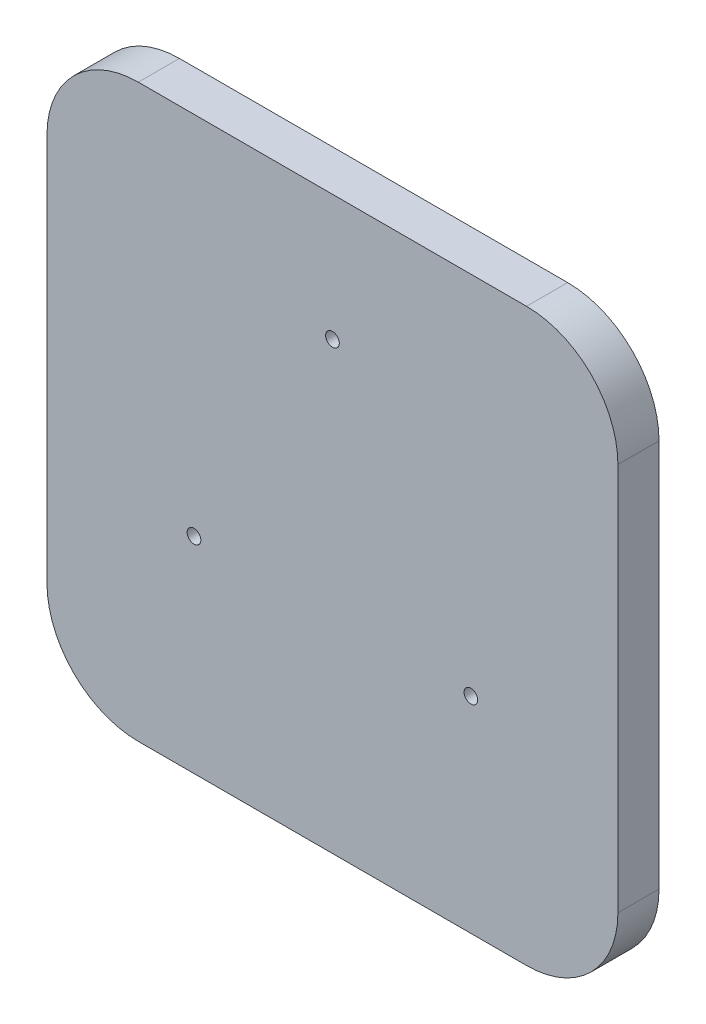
ISO-10303-21;
HEADER;
FILE_DESCRIPTION(('STEP AP214'),'2;1');
FILE_NAME('part.step','',(''),(''),'','','');
FILE_SCHEMA(('AUTOMOTIVE_DESIGN { 1 0 10303 214 1 1 1 1 }'));
ENDSEC;
DATA;
#1=APPLICATION_CONTEXT('core data for automotive mechanical design processes');
#2=APPLICATION_PROTOCOL_DEFINITION('international standard','automotive_design',2000,#1);
#3=PRODUCT_CONTEXT('',#1,'mechanical');
#4=PRODUCT('Part','Part','',(#3));
#5=PRODUCT_RELATED_PRODUCT_CATEGORY('part','',(#4));
#6=PRODUCT_DEFINITION_FORMATION('','',#4);
#7=PRODUCT_DEFINITION_CONTEXT('part definition',#1,'design');
#8=PRODUCT_DEFINITION('design','',#6,#7);
#9=PRODUCT_DEFINITION_SHAPE('','',#8);
#10=(LENGTH_UNIT() NAMED_UNIT(*) SI_UNIT(.MILLI.,.METRE.));
#11=(NAMED_UNIT(*) PLANE_ANGLE_UNIT() SI_UNIT($,.RADIAN.));
#12=(NAMED_UNIT(*) SI_UNIT($,.STERADIAN.) SOLID_ANGLE_UNIT());
#13=UNCERTAINTY_MEASURE_WITH_UNIT(LENGTH_MEASURE(1.E-05),#10,'distance_accuracy_value','');
#14=(GEOMETRIC_REPRESENTATION_CONTEXT(3) GLOBAL_UNCERTAINTY_ASSIGNED_CONTEXT((#13)) GLOBAL_UNIT_ASSIGNED_CONTEXT((#10,
#11,#12)) REPRESENTATION_CONTEXT('',''));
#15=CARTESIAN_POINT('',(0.,0.,0.));
#16=DIRECTION('',(0.,0.,1.));
#17=DIRECTION('',(1.,0.,0.));
#18=AXIS2_PLACEMENT_3D('',#15,#16,#17);
#19=CARTESIAN_POINT('',(0.,0.,18.));
#20=DIRECTION('',(1.,0.,0.));
#21=DIRECTION('',(0.,0.,-1.));
#22=AXIS2_PLACEMENT_3D('',#19,#20,#21);
#23=PLANE('',#22);
#24=DIRECTION('',(0.,-1.,0.));
#25=VECTOR('',#24,1.);
#26=CARTESIAN_POINT('',(0.,0.,0.));
#27=LINE('',#26,#25);
#28=CARTESIAN_POINT('',(0.,210.,0.));
#29=VERTEX_POINT('',#28);
#30=CARTESIAN_POINT('',(0.,40.,0.));
#31=VERTEX_POINT('',#30);
#32=EDGE_CURVE('E130',#29,#31,#27,.T.);
#33=ORIENTED_EDGE('',*,*,#32,.T.);
#34=DIRECTION('',(0.,0.,-1.));
#35=VECTOR('',#34,1.);
#36=CARTESIAN_POINT('',(0.,40.,18.));
#37=LINE('',#36,#35);
#38=CARTESIAN_POINT('',(0.,40.,18.));
#39=VERTEX_POINT('',#38);
#40=EDGE_CURVE('E152',#31,#39,#37,.F.);
#41=ORIENTED_EDGE('',*,*,#40,.T.);
#42=DIRECTION('',(0.,-1.,0.));
#43=VECTOR('',#42,1.);
#44=CARTESIAN_POINT('',(0.,0.,18.));
#45=LINE('',#44,#43);
#46=CARTESIAN_POINT('',(0.,210.,18.));
#47=VERTEX_POINT('',#46);
#48=EDGE_CURVE('E128',#47,#39,#45,.T.);
#49=ORIENTED_EDGE('',*,*,#48,.F.);
#50=DIRECTION('',(0.,0.,-1.));
#51=VECTOR('',#50,1.);
#52=CARTESIAN_POINT('',(0.,210.,18.));
#53=LINE('',#52,#51);
#54=EDGE_CURVE('E149',#47,#29,#53,.T.);
#55=ORIENTED_EDGE('',*,*,#54,.T.);
#56=EDGE_LOOP('',(#33,#41,#49,#55));
#57=FACE_BOUND('',#56,.T.);
#58=ADVANCED_FACE('F33',(#57),#23,.F.);
#59=CARTESIAN_POINT('',(0.,0.,18.));
#60=DIRECTION('',(0.,1.,0.));
#61=DIRECTION('',(0.,0.,1.));
#62=AXIS2_PLACEMENT_3D('',#59,#60,#61);
#63=PLANE('',#62);
#64=DIRECTION('',(1.,0.,0.));
#65=VECTOR('',#64,1.);
#66=CARTESIAN_POINT('',(0.,0.,0.));
#67=LINE('',#66,#65);
#68=CARTESIAN_POINT('',(40.,0.,0.));
#69=VERTEX_POINT('',#68);
#70=CARTESIAN_POINT('',(210.,0.,0.));
#71=VERTEX_POINT('',#70);
#72=EDGE_CURVE('E126',#69,#71,#67,.T.);
#73=ORIENTED_EDGE('',*,*,#72,.T.);
#74=DIRECTION('',(0.,0.,-1.));
#75=VECTOR('',#74,1.);
#76=CARTESIAN_POINT('',(210.,0.,18.));
#77=LINE('',#76,#75);
#78=CARTESIAN_POINT('',(210.,0.,18.));
#79=VERTEX_POINT('',#78);
#80=EDGE_CURVE('E104',#71,#79,#77,.F.);
#81=ORIENTED_EDGE('',*,*,#80,.T.);
#82=DIRECTION('',(1.,0.,0.));
#83=VECTOR('',#82,1.);
#84=CARTESIAN_POINT('',(0.,0.,18.));
#85=LINE('',#84,#83);
#86=CARTESIAN_POINT('',(40.,0.,18.));
#87=VERTEX_POINT('',#86);
#88=EDGE_CURVE('E166',#87,#79,#85,.T.);
#89=ORIENTED_EDGE('',*,*,#88,.F.);
#90=DIRECTION('',(0.,0.,-1.));
#91=VECTOR('',#90,1.);
#92=CARTESIAN_POINT('',(40.,0.,18.));
#93=LINE('',#92,#91);
#94=EDGE_CURVE('E109',#87,#69,#93,.T.);
#95=ORIENTED_EDGE('',*,*,#94,.T.);
#96=EDGE_LOOP('',(#73,#81,#89,#95));
#97=FACE_BOUND('',#96,.T.);
#98=ADVANCED_FACE('F171',(#97),#63,.F.);
#99=CARTESIAN_POINT('',(250.,0.,18.));
#100=DIRECTION('',(-1.,0.,0.));
#101=DIRECTION('',(0.,0.,1.));
#102=AXIS2_PLACEMENT_3D('',#99,#100,#101);
#103=PLANE('',#102);
#104=DIRECTION('',(0.,1.,0.));
#105=VECTOR('',#104,1.);
#106=CARTESIAN_POINT('',(250.,0.,18.));
#107=LINE('',#106,#105);
#108=CARTESIAN_POINT('',(250.,40.,18.));
#109=VERTEX_POINT('',#108);
#110=CARTESIAN_POINT('',(250.,210.,18.));
#111=VERTEX_POINT('',#110);
#112=EDGE_CURVE('E118',#109,#111,#107,.T.);
#113=ORIENTED_EDGE('',*,*,#112,.F.);
#114=DIRECTION('',(0.,0.,-1.));
#115=VECTOR('',#114,1.);
#116=CARTESIAN_POINT('',(250.,40.,18.));
#117=LINE('',#116,#115);
#118=CARTESIAN_POINT('',(250.,40.,0.));
#119=VERTEX_POINT('',#118);
#120=EDGE_CURVE('E103',#109,#119,#117,.T.);
#121=ORIENTED_EDGE('',*,*,#120,.T.);
#122=DIRECTION('',(0.,1.,0.));
#123=VECTOR('',#122,1.);
#124=CARTESIAN_POINT('',(250.,0.,0.));
#125=LINE('',#124,#123);
#126=CARTESIAN_POINT('',(250.,210.,0.));
#127=VERTEX_POINT('',#126);
#128=EDGE_CURVE('E116',#119,#127,#125,.T.);
#129=ORIENTED_EDGE('',*,*,#128,.T.);
#130=DIRECTION('',(0.,0.,-1.));
#131=VECTOR('',#130,1.);
#132=CARTESIAN_POINT('',(250.,210.,18.));
#133=LINE('',#132,#131);
#134=EDGE_CURVE('E120',#127,#111,#133,.F.);
#135=ORIENTED_EDGE('',*,*,#134,.T.);
#136=EDGE_LOOP('',(#113,#121,#129,#135));
#137=FACE_BOUND('',#136,.T.);
#138=ADVANCED_FACE('F115',(#137),#103,.F.);
#139=CARTESIAN_POINT('',(0.,250.,18.));
#140=DIRECTION('',(0.,-1.,0.));
#141=DIRECTION('',(0.,0.,-1.));
#142=AXIS2_PLACEMENT_3D('',#139,#140,#141);
#143=PLANE('',#142);
#144=DIRECTION('',(-1.,0.,0.));
#145=VECTOR('',#144,1.);
#146=CARTESIAN_POINT('',(0.,250.,18.));
#147=LINE('',#146,#145);
#148=CARTESIAN_POINT('',(210.,250.,18.));
#149=VERTEX_POINT('',#148);
#150=CARTESIAN_POINT('',(40.,250.,18.));
#151=VERTEX_POINT('',#150);
#152=EDGE_CURVE('E134',#149,#151,#147,.T.);
#153=ORIENTED_EDGE('',*,*,#152,.F.);
#154=DIRECTION('',(0.,0.,-1.));
#155=VECTOR('',#154,1.);
#156=CARTESIAN_POINT('',(210.,250.,18.));
#157=LINE('',#156,#155);
#158=CARTESIAN_POINT('',(210.,250.,0.));
#159=VERTEX_POINT('',#158);
#160=EDGE_CURVE('E11',#149,#159,#157,.T.);
#161=ORIENTED_EDGE('',*,*,#160,.T.);
#162=DIRECTION('',(-1.,0.,0.));
#163=VECTOR('',#162,1.);
#164=CARTESIAN_POINT('',(0.,250.,0.));
#165=LINE('',#164,#163);
#166=CARTESIAN_POINT('',(40.,250.,0.));
#167=VERTEX_POINT('',#166);
#168=EDGE_CURVE('E125',#159,#167,#165,.T.);
#169=ORIENTED_EDGE('',*,*,#168,.T.);
#170=DIRECTION('',(0.,0.,-1.));
#171=VECTOR('',#170,1.);
#172=CARTESIAN_POINT('',(40.,250.,18.));
#173=LINE('',#172,#171);
#174=EDGE_CURVE('E41',#167,#151,#173,.F.);
#175=ORIENTED_EDGE('',*,*,#174,.T.);
#176=EDGE_LOOP('',(#153,#161,#169,#175));
#177=FACE_BOUND('',#176,.T.);
#178=ADVANCED_FACE('F206',(#177),#143,.F.);
#179=CARTESIAN_POINT('',(0.,0.,18.));
#180=DIRECTION('',(0.,0.,-1.));
#181=DIRECTION('',(-1.,0.,0.));
#182=AXIS2_PLACEMENT_3D('',#179,#180,#181);
#183=PLANE('',#182);
#184=CARTESIAN_POINT('',(64.3782217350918,89.9999999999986,18.));
#185=DIRECTION('',(0.,0.,1.));
#186=DIRECTION('',(1.,0.,0.));
#187=AXIS2_PLACEMENT_3D('',#184,#185,#186);
#188=CIRCLE('',#187,3.00000000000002);
#189=CARTESIAN_POINT('',(67.3782217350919,89.9999999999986,18.));
#190=VERTEX_POINT('',#189);
#191=EDGE_CURVE('E189',#190,#190,#188,.T.);
#192=ORIENTED_EDGE('',*,*,#191,.F.);
#193=EDGE_LOOP('',(#192));
#194=FACE_BOUND('',#193,.T.);
#195=CARTESIAN_POINT('',(185.621778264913,90.0000000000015,18.));
#196=DIRECTION('',(0.,0.,1.));
#197=DIRECTION('',(1.,0.,0.));
#198=AXIS2_PLACEMENT_3D('',#195,#196,#197);
#199=CIRCLE('',#198,2.99999999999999);
#200=CARTESIAN_POINT('',(188.621778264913,90.0000000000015,18.));
#201=VERTEX_POINT('',#200);
#202=EDGE_CURVE('E183',#201,#201,#199,.T.);
#203=ORIENTED_EDGE('',*,*,#202,.F.);
#204=EDGE_LOOP('',(#203));
#205=FACE_BOUND('',#204,.T.);
#206=CARTESIAN_POINT('',(125.,195.,18.));
#207=DIRECTION('',(0.,0.,1.));
#208=DIRECTION('',(1.,0.,0.));
#209=AXIS2_PLACEMENT_3D('',#206,#207,#208);
#210=CIRCLE('',#209,2.99999999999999);
#211=CARTESIAN_POINT('',(128.,195.,18.));
#212=VERTEX_POINT('',#211);
#213=EDGE_CURVE('E174',#212,#212,#210,.T.);
#214=ORIENTED_EDGE('',*,*,#213,.F.);
#215=EDGE_LOOP('',(#214));
#216=FACE_BOUND('',#215,.T.);
#217=ORIENTED_EDGE('',*,*,#88,.T.);
#218=CARTESIAN_POINT('',(210.,40.,18.));
#219=DIRECTION('',(0.,0.,-1.));
#220=DIRECTION('',(-1.,0.,0.));
#221=AXIS2_PLACEMENT_3D('',#218,#219,#220);
#222=CIRCLE('',#221,40.);
#223=EDGE_CURVE('E147',#79,#109,#222,.F.);
#224=ORIENTED_EDGE('',*,*,#223,.T.);
#225=ORIENTED_EDGE('',*,*,#112,.T.);
#226=CARTESIAN_POINT('',(210.,210.,18.));
#227=DIRECTION('',(0.,0.,-1.));
#228=DIRECTION('',(-1.,0.,0.));
#229=AXIS2_PLACEMENT_3D('',#226,#227,#228);
#230=CIRCLE('',#229,40.);
#231=EDGE_CURVE('E54',#111,#149,#230,.F.);
#232=ORIENTED_EDGE('',*,*,#231,.T.);
#233=ORIENTED_EDGE('',*,*,#152,.T.);
#234=CARTESIAN_POINT('',(40.,210.,18.));
#235=DIRECTION('',(0.,0.,-1.));
#236=DIRECTION('',(-1.,0.,0.));
#237=AXIS2_PLACEMENT_3D('',#234,#235,#236);
#238=CIRCLE('',#237,40.);
#239=EDGE_CURVE('E142',#151,#47,#238,.F.);
#240=ORIENTED_EDGE('',*,*,#239,.T.);
#241=ORIENTED_EDGE('',*,*,#48,.T.);
#242=CARTESIAN_POINT('',(40.,40.,18.));
#243=DIRECTION('',(0.,0.,-1.));
#244=DIRECTION('',(-1.,0.,0.));
#245=AXIS2_PLACEMENT_3D('',#242,#243,#244);
#246=CIRCLE('',#245,40.);
#247=EDGE_CURVE('E145',#39,#87,#246,.F.);
#248=ORIENTED_EDGE('',*,*,#247,.T.);
#249=EDGE_LOOP('',(#217,#224,#225,#232,#233,#240,#241,#248));
#250=FACE_BOUND('',#249,.T.);
#251=ADVANCED_FACE('F163',(#194,#205,#216,#250),#183,.F.);
#252=CARTESIAN_POINT('',(0.,0.,0.));
#253=DIRECTION('',(0.,0.,-1.));
#254=DIRECTION('',(-1.,0.,0.));
#255=AXIS2_PLACEMENT_3D('',#252,#253,#254);
#256=PLANE('',#255);
#257=CARTESIAN_POINT('',(64.3782217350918,89.9999999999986,0.));
#258=DIRECTION('',(0.,0.,1.));
#259=DIRECTION('',(1.,0.,0.));
#260=AXIS2_PLACEMENT_3D('',#257,#258,#259);
#261=CIRCLE('',#260,3.00000000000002);
#262=CARTESIAN_POINT('',(67.3782217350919,89.9999999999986,0.));
#263=VERTEX_POINT('',#262);
#264=EDGE_CURVE('E186',#263,#263,#261,.T.);
#265=ORIENTED_EDGE('',*,*,#264,.T.);
#266=EDGE_LOOP('',(#265));
#267=FACE_BOUND('',#266,.T.);
#268=CARTESIAN_POINT('',(185.621778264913,90.0000000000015,0.));
#269=DIRECTION('',(0.,0.,1.));
#270=DIRECTION('',(1.,0.,0.));
#271=AXIS2_PLACEMENT_3D('',#268,#269,#270);
#272=CIRCLE('',#271,2.99999999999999);
#273=CARTESIAN_POINT('',(188.621778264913,90.0000000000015,0.));
#274=VERTEX_POINT('',#273);
#275=EDGE_CURVE('E181',#274,#274,#272,.T.);
#276=ORIENTED_EDGE('',*,*,#275,.T.);
#277=EDGE_LOOP('',(#276));
#278=FACE_BOUND('',#277,.T.);
#279=CARTESIAN_POINT('',(125.,195.,0.));
#280=DIRECTION('',(0.,0.,1.));
#281=DIRECTION('',(1.,0.,0.));
#282=AXIS2_PLACEMENT_3D('',#279,#280,#281);
#283=CIRCLE('',#282,2.99999999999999);
#284=CARTESIAN_POINT('',(128.,195.,0.));
#285=VERTEX_POINT('',#284);
#286=EDGE_CURVE('E172',#285,#285,#283,.T.);
#287=ORIENTED_EDGE('',*,*,#286,.T.);
#288=EDGE_LOOP('',(#287));
#289=FACE_BOUND('',#288,.T.);
#290=ORIENTED_EDGE('',*,*,#128,.F.);
#291=CARTESIAN_POINT('',(210.,40.,0.));
#292=DIRECTION('',(0.,0.,-1.));
#293=DIRECTION('',(-1.,0.,0.));
#294=AXIS2_PLACEMENT_3D('',#291,#292,#293);
#295=CIRCLE('',#294,40.);
#296=EDGE_CURVE('E99',#119,#71,#295,.T.);
#297=ORIENTED_EDGE('',*,*,#296,.T.);
#298=ORIENTED_EDGE('',*,*,#72,.F.);
#299=CARTESIAN_POINT('',(40.,40.,0.));
#300=DIRECTION('',(0.,0.,-1.));
#301=DIRECTION('',(-1.,0.,0.));
#302=AXIS2_PLACEMENT_3D('',#299,#300,#301);
#303=CIRCLE('',#302,40.);
#304=EDGE_CURVE('E110',#69,#31,#303,.T.);
#305=ORIENTED_EDGE('',*,*,#304,.T.);
#306=ORIENTED_EDGE('',*,*,#32,.F.);
#307=CARTESIAN_POINT('',(40.,210.,0.));
#308=DIRECTION('',(0.,0.,-1.));
#309=DIRECTION('',(-1.,0.,0.));
#310=AXIS2_PLACEMENT_3D('',#307,#308,#309);
#311=CIRCLE('',#310,40.);
#312=EDGE_CURVE('E119',#29,#167,#311,.T.);
#313=ORIENTED_EDGE('',*,*,#312,.T.);
#314=ORIENTED_EDGE('',*,*,#168,.F.);
#315=CARTESIAN_POINT('',(210.,210.,0.));
#316=DIRECTION('',(0.,0.,-1.));
#317=DIRECTION('',(-1.,0.,0.));
#318=AXIS2_PLACEMENT_3D('',#315,#316,#317);
#319=CIRCLE('',#318,40.);
#320=EDGE_CURVE('E124',#159,#127,#319,.T.);
#321=ORIENTED_EDGE('',*,*,#320,.T.);
#322=EDGE_LOOP('',(#290,#297,#298,#305,#306,#313,#314,#321));
#323=FACE_BOUND('',#322,.T.);
#324=ADVANCED_FACE('F122',(#267,#278,#289,#323),#256,.T.);
#325=CARTESIAN_POINT('',(125.,195.,0.));
#326=DIRECTION('',(0.,0.,1.));
#327=DIRECTION('',(1.,0.,0.));
#328=AXIS2_PLACEMENT_3D('',#325,#326,#327);
#329=CYLINDRICAL_SURFACE('',#328,2.99999999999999);
#330=ORIENTED_EDGE('',*,*,#286,.F.);
#331=EDGE_LOOP('',(#330));
#332=FACE_BOUND('',#331,.T.);
#333=ORIENTED_EDGE('',*,*,#213,.T.);
#334=EDGE_LOOP('',(#333));
#335=FACE_BOUND('',#334,.T.);
#336=ADVANCED_FACE('F212',(#332,#335),#329,.F.);
#337=CARTESIAN_POINT('',(185.621778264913,90.0000000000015,0.));
#338=DIRECTION('',(0.,0.,1.));
#339=DIRECTION('',(1.,0.,0.));
#340=AXIS2_PLACEMENT_3D('',#337,#338,#339);
#341=CYLINDRICAL_SURFACE('',#340,2.99999999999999);
#342=ORIENTED_EDGE('',*,*,#275,.F.);
#343=EDGE_LOOP('',(#342));
#344=FACE_BOUND('',#343,.T.);
#345=ORIENTED_EDGE('',*,*,#202,.T.);
#346=EDGE_LOOP('',(#345));
#347=FACE_BOUND('',#346,.T.);
#348=ADVANCED_FACE('F200',(#344,#347),#341,.F.);
#349=CARTESIAN_POINT('',(64.3782217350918,89.9999999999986,0.));
#350=DIRECTION('',(0.,0.,1.));
#351=DIRECTION('',(1.,0.,0.));
#352=AXIS2_PLACEMENT_3D('',#349,#350,#351);
#353=CYLINDRICAL_SURFACE('',#352,3.00000000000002);
#354=ORIENTED_EDGE('',*,*,#264,.F.);
#355=EDGE_LOOP('',(#354));
#356=FACE_BOUND('',#355,.T.);
#357=ORIENTED_EDGE('',*,*,#191,.T.);
#358=EDGE_LOOP('',(#357));
#359=FACE_BOUND('',#358,.T.);
#360=ADVANCED_FACE('F197',(#356,#359),#353,.F.);
#361=CARTESIAN_POINT('',(210.,40.,18.));
#362=DIRECTION('',(0.,0.,-1.));
#363=DIRECTION('',(-1.,0.,0.));
#364=AXIS2_PLACEMENT_3D('',#361,#362,#363);
#365=CYLINDRICAL_SURFACE('',#364,40.);
#366=ORIENTED_EDGE('',*,*,#223,.F.);
#367=ORIENTED_EDGE('',*,*,#80,.F.);
#368=ORIENTED_EDGE('',*,*,#296,.F.);
#369=ORIENTED_EDGE('',*,*,#120,.F.);
#370=EDGE_LOOP('',(#366,#367,#368,#369));
#371=FACE_BOUND('',#370,.T.);
#372=ADVANCED_FACE('F102',(#371),#365,.T.);
#373=CARTESIAN_POINT('',(40.,40.,18.));
#374=DIRECTION('',(0.,0.,-1.));
#375=DIRECTION('',(-1.,0.,0.));
#376=AXIS2_PLACEMENT_3D('',#373,#374,#375);
#377=CYLINDRICAL_SURFACE('',#376,40.);
#378=ORIENTED_EDGE('',*,*,#247,.F.);
#379=ORIENTED_EDGE('',*,*,#40,.F.);
#380=ORIENTED_EDGE('',*,*,#304,.F.);
#381=ORIENTED_EDGE('',*,*,#94,.F.);
#382=EDGE_LOOP('',(#378,#379,#380,#381));
#383=FACE_BOUND('',#382,.T.);
#384=ADVANCED_FACE('F169',(#383),#377,.T.);
#385=CARTESIAN_POINT('',(210.,210.,18.));
#386=DIRECTION('',(0.,0.,-1.));
#387=DIRECTION('',(-1.,0.,0.));
#388=AXIS2_PLACEMENT_3D('',#385,#386,#387);
#389=CYLINDRICAL_SURFACE('',#388,40.);
#390=ORIENTED_EDGE('',*,*,#231,.F.);
#391=ORIENTED_EDGE('',*,*,#134,.F.);
#392=ORIENTED_EDGE('',*,*,#320,.F.);
#393=ORIENTED_EDGE('',*,*,#160,.F.);
#394=EDGE_LOOP('',(#390,#391,#392,#393));
#395=FACE_BOUND('',#394,.T.);
#396=ADVANCED_FACE('F237',(#395),#389,.T.);
#397=CARTESIAN_POINT('',(40.,210.,18.));
#398=DIRECTION('',(0.,0.,-1.));
#399=DIRECTION('',(-1.,0.,0.));
#400=AXIS2_PLACEMENT_3D('',#397,#398,#399);
#401=CYLINDRICAL_SURFACE('',#400,40.);
#402=ORIENTED_EDGE('',*,*,#239,.F.);
#403=ORIENTED_EDGE('',*,*,#174,.F.);
#404=ORIENTED_EDGE('',*,*,#312,.F.);
#405=ORIENTED_EDGE('',*,*,#54,.F.);
#406=EDGE_LOOP('',(#402,#403,#404,#405));
#407=FACE_BOUND('',#406,.T.);
#408=ADVANCED_FACE('F35',(#407),#401,.T.);
#409=CLOSED_SHELL('',(#58,#98,#138,#178,#251,#324,#336,#348,#360,#372,#384,#396,#408));
#410=MANIFOLD_SOLID_BREP('B2',#409);
#411=ADVANCED_BREP_SHAPE_REPRESENTATION('',(#18,#410),#14);
#412=SHAPE_DEFINITION_REPRESENTATION(#9,#411);
ENDSEC;
END-ISO-10303-21;
